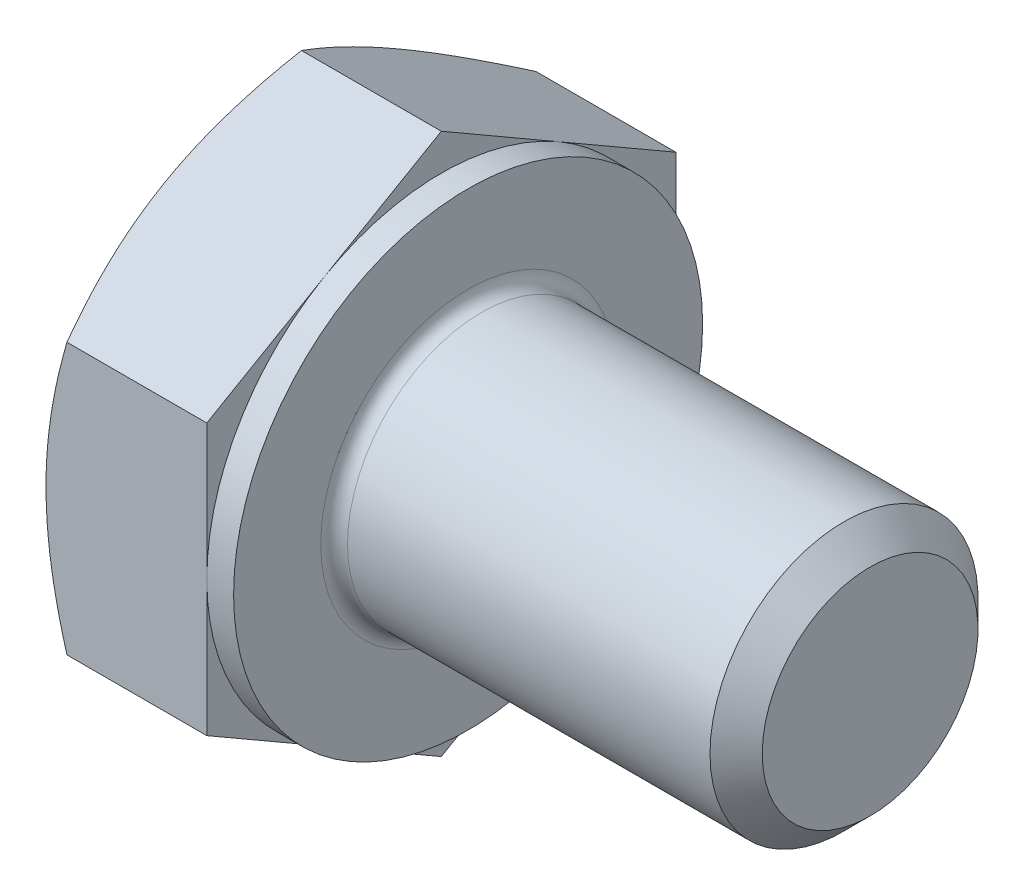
ISO-10303-21;
HEADER;
FILE_DESCRIPTION(('STEP AP214'),'2;1');
FILE_NAME('part.step','',(''),(''),'','','');
FILE_SCHEMA(('AUTOMOTIVE_DESIGN { 1 0 10303 214 1 1 1 1 }'));
ENDSEC;
DATA;
#1=APPLICATION_CONTEXT('core data for automotive mechanical design processes');
#2=APPLICATION_PROTOCOL_DEFINITION('international standard','automotive_design',2000,#1);
#3=PRODUCT_CONTEXT('',#1,'mechanical');
#4=PRODUCT('Part','Part','',(#3));
#5=PRODUCT_RELATED_PRODUCT_CATEGORY('part','',(#4));
#6=PRODUCT_DEFINITION_FORMATION('','',#4);
#7=PRODUCT_DEFINITION_CONTEXT('part definition',#1,'design');
#8=PRODUCT_DEFINITION('design','',#6,#7);
#9=PRODUCT_DEFINITION_SHAPE('','',#8);
#10=(LENGTH_UNIT() NAMED_UNIT(*) SI_UNIT(.MILLI.,.METRE.));
#11=(NAMED_UNIT(*) PLANE_ANGLE_UNIT() SI_UNIT($,.RADIAN.));
#12=(NAMED_UNIT(*) SI_UNIT($,.STERADIAN.) SOLID_ANGLE_UNIT());
#13=UNCERTAINTY_MEASURE_WITH_UNIT(LENGTH_MEASURE(1.E-05),#10,'distance_accuracy_value','');
#14=(GEOMETRIC_REPRESENTATION_CONTEXT(3) GLOBAL_UNCERTAINTY_ASSIGNED_CONTEXT((#13)) GLOBAL_UNIT_ASSIGNED_CONTEXT((#10,
#11,#12)) REPRESENTATION_CONTEXT('',''));
#15=CARTESIAN_POINT('',(0.,0.,0.));
#16=DIRECTION('',(0.,0.,1.));
#17=DIRECTION('',(1.,0.,0.));
#18=AXIS2_PLACEMENT_3D('',#15,#16,#17);
#19=CARTESIAN_POINT('',(2.8,4.04145188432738,0.));
#20=DIRECTION('',(1.,0.,0.));
#21=DIRECTION('',(0.,0.,-1.));
#22=AXIS2_PLACEMENT_3D('',#19,#20,#21);
#23=PLANE('',#22);
#24=CARTESIAN_POINT('',(2.8,0.,0.));
#25=DIRECTION('',(1.,0.,0.));
#26=DIRECTION('',(0.,0.,-1.));
#27=AXIS2_PLACEMENT_3D('',#24,#25,#26);
#28=CIRCLE('',#27,2.2);
#29=CARTESIAN_POINT('',(2.8,0.,-2.2));
#30=VERTEX_POINT('',#29);
#31=EDGE_CURVE('E44',#30,#30,#28,.F.);
#32=ORIENTED_EDGE('',*,*,#31,.T.);
#33=EDGE_LOOP('',(#32));
#34=FACE_BOUND('',#33,.T.);
#35=CARTESIAN_POINT('',(2.8,0.,0.));
#36=DIRECTION('',(1.,0.,0.));
#37=DIRECTION('',(0.,0.,-1.));
#38=AXIS2_PLACEMENT_3D('',#35,#36,#37);
#39=CIRCLE('',#38,3.5);
#40=CARTESIAN_POINT('',(2.8,0.,-3.5));
#41=VERTEX_POINT('',#40);
#42=EDGE_CURVE('E301',#41,#41,#39,.T.);
#43=ORIENTED_EDGE('',*,*,#42,.T.);
#44=EDGE_LOOP('',(#43));
#45=FACE_BOUND('',#44,.T.);
#46=ADVANCED_FACE('F36',(#34,#45),#23,.T.);
#47=CARTESIAN_POINT('',(0.,0.,0.));
#48=DIRECTION('',(-1.,0.,0.));
#49=DIRECTION('',(0.,0.,1.));
#50=AXIS2_PLACEMENT_3D('',#47,#48,#49);
#51=CYLINDRICAL_SURFACE('',#50,2.);
#52=CARTESIAN_POINT('',(3.,0.,0.));
#53=DIRECTION('',(1.,0.,0.));
#54=DIRECTION('',(0.,0.,-1.));
#55=AXIS2_PLACEMENT_3D('',#52,#53,#54);
#56=CIRCLE('',#55,2.);
#57=CARTESIAN_POINT('',(3.,0.,-2.));
#58=VERTEX_POINT('',#57);
#59=EDGE_CURVE('E11',#58,#58,#56,.T.);
#60=ORIENTED_EDGE('',*,*,#59,.T.);
#61=EDGE_LOOP('',(#60));
#62=FACE_BOUND('',#61,.T.);
#63=CARTESIAN_POINT('',(8.41,0.,0.));
#64=DIRECTION('',(-1.,0.,0.));
#65=DIRECTION('',(0.,0.,1.));
#66=AXIS2_PLACEMENT_3D('',#63,#64,#65);
#67=CIRCLE('',#66,2.);
#68=CARTESIAN_POINT('',(8.41,0.,2.));
#69=VERTEX_POINT('',#68);
#70=EDGE_CURVE('E280',#69,#69,#67,.T.);
#71=ORIENTED_EDGE('',*,*,#70,.T.);
#72=EDGE_LOOP('',(#71));
#73=FACE_BOUND('',#72,.T.);
#74=ADVANCED_FACE('F254',(#62,#73),#51,.T.);
#75=CARTESIAN_POINT('',(8.8,0.,0.));
#76=DIRECTION('',(-1.,0.,0.));
#77=DIRECTION('',(0.,0.,1.));
#78=AXIS2_PLACEMENT_3D('',#75,#76,#77);
#79=CONICAL_SURFACE('',#78,1.61,0.785398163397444);
#80=ORIENTED_EDGE('',*,*,#70,.F.);
#81=EDGE_LOOP('',(#80));
#82=FACE_BOUND('',#81,.T.);
#83=CARTESIAN_POINT('',(8.8,0.,0.));
#84=DIRECTION('',(-1.,0.,0.));
#85=DIRECTION('',(0.,0.,1.));
#86=AXIS2_PLACEMENT_3D('',#83,#84,#85);
#87=CIRCLE('',#86,1.61);
#88=CARTESIAN_POINT('',(8.8,0.,1.61));
#89=VERTEX_POINT('',#88);
#90=EDGE_CURVE('E278',#89,#89,#87,.T.);
#91=ORIENTED_EDGE('',*,*,#90,.T.);
#92=EDGE_LOOP('',(#91));
#93=FACE_BOUND('',#92,.T.);
#94=ADVANCED_FACE('F259',(#82,#93),#79,.T.);
#95=CARTESIAN_POINT('',(8.8,0.,0.));
#96=DIRECTION('',(-1.,0.,0.));
#97=DIRECTION('',(0.,0.,1.));
#98=AXIS2_PLACEMENT_3D('',#95,#96,#97);
#99=PLANE('',#98);
#100=ORIENTED_EDGE('',*,*,#90,.F.);
#101=EDGE_LOOP('',(#100));
#102=FACE_BOUND('',#101,.T.);
#103=ADVANCED_FACE('F266',(#102),#99,.F.);
#104=CARTESIAN_POINT('',(2.4,3.5,0.));
#105=DIRECTION('',(1.,0.,0.));
#106=DIRECTION('',(0.,0.,-1.));
#107=AXIS2_PLACEMENT_3D('',#104,#105,#106);
#108=PLANE('',#107);
#109=DIRECTION('',(0.,0.500000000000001,0.866025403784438));
#110=VECTOR('',#109,1.);
#111=CARTESIAN_POINT('',(2.4,2.02072594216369,-3.5));
#112=LINE('',#111,#110);
#113=CARTESIAN_POINT('',(2.4,2.02072594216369,-3.5));
#114=VERTEX_POINT('',#113);
#115=CARTESIAN_POINT('',(2.4,3.03108891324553,-1.75));
#116=VERTEX_POINT('',#115);
#117=EDGE_CURVE('E168',#114,#116,#112,.T.);
#118=ORIENTED_EDGE('',*,*,#117,.T.);
#119=CARTESIAN_POINT('',(2.4,0.,0.));
#120=DIRECTION('',(-1.,0.,0.));
#121=DIRECTION('',(0.,0.,1.));
#122=AXIS2_PLACEMENT_3D('',#119,#120,#121);
#123=CIRCLE('',#122,3.5);
#124=CARTESIAN_POINT('',(2.4,0.,-3.5));
#125=VERTEX_POINT('',#124);
#126=EDGE_CURVE('E51',#116,#125,#123,.T.);
#127=ORIENTED_EDGE('',*,*,#126,.T.);
#128=DIRECTION('',(0.,1.,0.));
#129=VECTOR('',#128,1.);
#130=CARTESIAN_POINT('',(2.4,2.02072594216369,-3.5));
#131=LINE('',#130,#129);
#132=EDGE_CURVE('E304',#125,#114,#131,.T.);
#133=ORIENTED_EDGE('',*,*,#132,.T.);
#134=EDGE_LOOP('',(#118,#127,#133));
#135=FACE_BOUND('',#134,.T.);
#136=ADVANCED_FACE('F269',(#135),#108,.T.);
#137=CARTESIAN_POINT('',(2.4,4.04145188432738,0.));
#138=VERTEX_POINT('',#137);
#139=EDGE_CURVE('E166',#116,#138,#112,.T.);
#140=ORIENTED_EDGE('',*,*,#139,.T.);
#141=DIRECTION('',(0.,-0.500000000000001,0.866025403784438));
#142=VECTOR('',#141,1.);
#143=CARTESIAN_POINT('',(2.4,4.04145188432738,0.));
#144=LINE('',#143,#142);
#145=CARTESIAN_POINT('',(2.4,3.03108891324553,1.75));
#146=VERTEX_POINT('',#145);
#147=EDGE_CURVE('E165',#138,#146,#144,.T.);
#148=ORIENTED_EDGE('',*,*,#147,.T.);
#149=EDGE_CURVE('E154',#146,#116,#123,.T.);
#150=ORIENTED_EDGE('',*,*,#149,.T.);
#151=EDGE_LOOP('',(#140,#148,#150));
#152=FACE_BOUND('',#151,.T.);
#153=ADVANCED_FACE('F274',(#152),#108,.T.);
#154=CARTESIAN_POINT('',(2.4,2.02072594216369,3.5));
#155=VERTEX_POINT('',#154);
#156=EDGE_CURVE('E133',#146,#155,#144,.T.);
#157=ORIENTED_EDGE('',*,*,#156,.T.);
#158=DIRECTION('',(0.,-1.,0.));
#159=VECTOR('',#158,1.);
#160=CARTESIAN_POINT('',(2.4,2.02072594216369,3.5));
#161=LINE('',#160,#159);
#162=CARTESIAN_POINT('',(2.4,0.,3.5));
#163=VERTEX_POINT('',#162);
#164=EDGE_CURVE('E127',#155,#163,#161,.T.);
#165=ORIENTED_EDGE('',*,*,#164,.T.);
#166=EDGE_CURVE('E131',#163,#146,#123,.T.);
#167=ORIENTED_EDGE('',*,*,#166,.T.);
#168=EDGE_LOOP('',(#157,#165,#167));
#169=FACE_BOUND('',#168,.T.);
#170=ADVANCED_FACE('F129',(#169),#108,.T.);
#171=CARTESIAN_POINT('',(2.4,-2.02072594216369,3.5));
#172=VERTEX_POINT('',#171);
#173=EDGE_CURVE('E137',#163,#172,#161,.T.);
#174=ORIENTED_EDGE('',*,*,#173,.T.);
#175=DIRECTION('',(0.,-0.500000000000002,-0.866025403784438));
#176=VECTOR('',#175,1.);
#177=CARTESIAN_POINT('',(2.4,-4.04145188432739,0.));
#178=LINE('',#177,#176);
#179=CARTESIAN_POINT('',(2.4,-3.03108891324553,1.75000000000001));
#180=VERTEX_POINT('',#179);
#181=EDGE_CURVE('E144',#172,#180,#178,.T.);
#182=ORIENTED_EDGE('',*,*,#181,.T.);
#183=EDGE_CURVE('E141',#180,#163,#123,.T.);
#184=ORIENTED_EDGE('',*,*,#183,.T.);
#185=EDGE_LOOP('',(#174,#182,#184));
#186=FACE_BOUND('',#185,.T.);
#187=ADVANCED_FACE('F142',(#186),#108,.T.);
#188=CARTESIAN_POINT('',(2.4,-4.04145188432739,0.));
#189=VERTEX_POINT('',#188);
#190=EDGE_CURVE('E160',#180,#189,#178,.T.);
#191=ORIENTED_EDGE('',*,*,#190,.T.);
#192=DIRECTION('',(0.,0.500000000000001,-0.866025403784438));
#193=VECTOR('',#192,1.);
#194=CARTESIAN_POINT('',(2.4,-2.0207259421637,-3.5));
#195=LINE('',#194,#193);
#196=CARTESIAN_POINT('',(2.4,-3.03108891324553,-1.75));
#197=VERTEX_POINT('',#196);
#198=EDGE_CURVE('E342',#189,#197,#195,.T.);
#199=ORIENTED_EDGE('',*,*,#198,.T.);
#200=EDGE_CURVE('E148',#197,#180,#123,.T.);
#201=ORIENTED_EDGE('',*,*,#200,.T.);
#202=EDGE_LOOP('',(#191,#199,#201));
#203=FACE_BOUND('',#202,.T.);
#204=ADVANCED_FACE('F343',(#203),#108,.T.);
#205=CARTESIAN_POINT('',(2.4,-2.0207259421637,-3.5));
#206=VERTEX_POINT('',#205);
#207=EDGE_CURVE('E155',#197,#206,#195,.T.);
#208=ORIENTED_EDGE('',*,*,#207,.T.);
#209=EDGE_CURVE('E305',#206,#125,#131,.T.);
#210=ORIENTED_EDGE('',*,*,#209,.T.);
#211=EDGE_CURVE('E312',#125,#197,#123,.T.);
#212=ORIENTED_EDGE('',*,*,#211,.T.);
#213=EDGE_LOOP('',(#208,#210,#212));
#214=FACE_BOUND('',#213,.T.);
#215=ADVANCED_FACE('F275',(#214),#108,.T.);
#216=CARTESIAN_POINT('',(0.,0.,0.));
#217=DIRECTION('',(-1.,0.,0.));
#218=DIRECTION('',(0.,0.,1.));
#219=AXIS2_PLACEMENT_3D('',#216,#217,#218);
#220=CYLINDRICAL_SURFACE('',#219,3.5);
#221=ORIENTED_EDGE('',*,*,#126,.F.);
#222=ORIENTED_EDGE('',*,*,#149,.F.);
#223=ORIENTED_EDGE('',*,*,#166,.F.);
#224=ORIENTED_EDGE('',*,*,#183,.F.);
#225=ORIENTED_EDGE('',*,*,#200,.F.);
#226=ORIENTED_EDGE('',*,*,#211,.F.);
#227=EDGE_LOOP('',(#221,#222,#223,#224,#225,#226));
#228=FACE_BOUND('',#227,.T.);
#229=ORIENTED_EDGE('',*,*,#42,.F.);
#230=EDGE_LOOP('',(#229));
#231=FACE_BOUND('',#230,.T.);
#232=ADVANCED_FACE('F151',(#228,#231),#220,.T.);
#233=CARTESIAN_POINT('',(0.,4.04145188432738,0.));
#234=DIRECTION('',(1.,0.,0.));
#235=DIRECTION('',(0.,0.,-1.));
#236=AXIS2_PLACEMENT_3D('',#233,#234,#235);
#237=PLANE('',#236);
#238=CARTESIAN_POINT('',(0.,0.,0.));
#239=DIRECTION('',(1.,0.,0.));
#240=DIRECTION('',(0.,0.,-1.));
#241=AXIS2_PLACEMENT_3D('',#238,#239,#240);
#242=CIRCLE('',#241,3.5);
#243=CARTESIAN_POINT('',(0.,0.,-3.5));
#244=VERTEX_POINT('',#243);
#245=CARTESIAN_POINT('',(0.,3.03108891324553,-1.75));
#246=VERTEX_POINT('',#245);
#247=EDGE_CURVE('E300',#244,#246,#242,.T.);
#248=ORIENTED_EDGE('',*,*,#247,.F.);
#249=CARTESIAN_POINT('',(0.,-3.03108891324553,-1.75));
#250=VERTEX_POINT('',#249);
#251=EDGE_CURVE('E296',#250,#244,#242,.T.);
#252=ORIENTED_EDGE('',*,*,#251,.F.);
#253=CARTESIAN_POINT('',(0.,-3.03108891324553,1.75000000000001));
#254=VERTEX_POINT('',#253);
#255=EDGE_CURVE('E299',#254,#250,#242,.T.);
#256=ORIENTED_EDGE('',*,*,#255,.F.);
#257=CARTESIAN_POINT('',(0.,0.,3.5));
#258=VERTEX_POINT('',#257);
#259=EDGE_CURVE('E335',#258,#254,#242,.T.);
#260=ORIENTED_EDGE('',*,*,#259,.F.);
#261=CARTESIAN_POINT('',(0.,0.,0.));
#262=DIRECTION('',(-1.,0.,0.));
#263=DIRECTION('',(0.,0.,1.));
#264=AXIS2_PLACEMENT_3D('',#261,#262,#263);
#265=CIRCLE('',#264,3.5);
#266=CARTESIAN_POINT('',(0.,3.03108891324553,1.75));
#267=VERTEX_POINT('',#266);
#268=EDGE_CURVE('E169',#258,#267,#265,.T.);
#269=ORIENTED_EDGE('',*,*,#268,.T.);
#270=EDGE_CURVE('E358',#246,#267,#242,.T.);
#271=ORIENTED_EDGE('',*,*,#270,.F.);
#272=EDGE_LOOP('',(#248,#252,#256,#260,#269,#271));
#273=FACE_BOUND('',#272,.T.);
#274=ADVANCED_FACE('F200',(#273),#237,.F.);
#275=CARTESIAN_POINT('',(0.,0.,0.));
#276=DIRECTION('',(1.,0.,0.));
#277=DIRECTION('',(0.,0.,-1.));
#278=AXIS2_PLACEMENT_3D('',#275,#276,#277);
#279=CONICAL_SURFACE('',#278,3.5,1.0471975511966);
#280=CARTESIAN_POINT('',(0.312674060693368,2.02061047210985,3.5002));
#281=CARTESIAN_POINT('',(0.26138578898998,2.10941108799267,3.34639282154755));
#282=CARTESIAN_POINT('',(0.214740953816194,2.19897822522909,3.19125798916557));
#283=CARTESIAN_POINT('',(0.133321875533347,2.37966345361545,2.87830199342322));
#284=CARTESIAN_POINT('',(0.0985764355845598,2.47078475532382,2.7204752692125));
#285=CARTESIAN_POINT('',(0.044490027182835,2.65189807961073,2.40677778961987));
#286=CARTESIAN_POINT('',(0.0247890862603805,2.74186223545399,2.25095530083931));
#287=CARTESIAN_POINT('',(0.00127013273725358,2.92221386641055,1.93857711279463));
#288=CARTESIAN_POINT('',(-0.00256735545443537,3.01260068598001,1.78202254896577));
#289=CARTESIAN_POINT('',(0.00541530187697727,3.1814939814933,1.48949078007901));
#290=CARTESIAN_POINT('',(0.0152754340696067,3.26002573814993,1.35346978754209));
#291=CARTESIAN_POINT('',(0.0465264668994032,3.41657761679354,1.08231397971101));
#292=CARTESIAN_POINT('',(0.0679280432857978,3.49459719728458,0.947180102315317));
#293=CARTESIAN_POINT('',(0.121430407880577,3.65147186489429,0.675465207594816));
#294=CARTESIAN_POINT('',(0.153757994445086,3.73030709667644,0.538918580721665));
#295=CARTESIAN_POINT('',(0.227128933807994,3.88680174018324,0.267861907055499));
#296=CARTESIAN_POINT('',(0.268155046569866,3.96446315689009,0.133348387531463));
#297=CARTESIAN_POINT('',(0.31267406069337,4.04156735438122,-0.000200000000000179));
#298=B_SPLINE_CURVE_WITH_KNOTS('',3,(#280,#281,#282,#283,#284,#285,#286,#287,#288,#289,#290,
#291,#292,#293,#294,#295,#296,#297),.UNSPECIFIED.,.F.,.F.,(4,2,2,2,2,2,2,2,4),(0.,
0.554793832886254,1.11092123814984,1.65328467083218,2.19498204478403,2.6666513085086,
3.13875761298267,3.62133612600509,4.10296698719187),.UNSPECIFIED.);
#299=CARTESIAN_POINT('',(0.312607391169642,4.04145188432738,0.));
#300=VERTEX_POINT('',#299);
#301=EDGE_CURVE('E220',#267,#300,#298,.T.);
#302=ORIENTED_EDGE('',*,*,#301,.T.);
#303=CARTESIAN_POINT('',(0.31267406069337,4.04156735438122,0.0002));
#304=CARTESIAN_POINT('',(0.261385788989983,3.9527667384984,-0.15360717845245));
#305=CARTESIAN_POINT('',(0.214740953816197,3.86319960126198,-0.308742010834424));
#306=CARTESIAN_POINT('',(0.133321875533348,3.68251437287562,-0.621698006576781));
#307=CARTESIAN_POINT('',(0.098576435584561,3.59139307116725,-0.779524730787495));
#308=CARTESIAN_POINT('',(0.0444900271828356,3.41027974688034,-1.09322221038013));
#309=CARTESIAN_POINT('',(0.024789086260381,3.32031559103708,-1.24904469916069));
#310=CARTESIAN_POINT('',(0.00127013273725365,3.13996396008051,-1.56142288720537));
#311=CARTESIAN_POINT('',(-0.00256735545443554,3.04957714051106,-1.71797745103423));
#312=CARTESIAN_POINT('',(0.00541530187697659,2.88068384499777,-2.01050921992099));
#313=CARTESIAN_POINT('',(0.0152754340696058,2.80215208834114,-2.1465302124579));
#314=CARTESIAN_POINT('',(0.0465264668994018,2.64560020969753,-2.41768602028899));
#315=CARTESIAN_POINT('',(0.0679280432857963,2.56758062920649,-2.55281989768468));
#316=CARTESIAN_POINT('',(0.121430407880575,2.41070596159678,-2.82453479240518));
#317=CARTESIAN_POINT('',(0.153757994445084,2.33187072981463,-2.96108141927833));
#318=CARTESIAN_POINT('',(0.227128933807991,2.17537608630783,-3.2321380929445));
#319=CARTESIAN_POINT('',(0.268155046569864,2.09771466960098,-3.36665161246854));
#320=CARTESIAN_POINT('',(0.312674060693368,2.02061047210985,-3.5002));
#321=B_SPLINE_CURVE_WITH_KNOTS('',3,(#303,#304,#305,#306,#307,#308,#309,#310,#311,#312,#313,
#314,#315,#316,#317,#318,#319,#320),.UNSPECIFIED.,.F.,.F.,(4,2,2,2,2,2,2,2,4),(0.,
0.554793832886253,1.11092123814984,1.65328467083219,2.19498204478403,2.6666513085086,
3.13875761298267,3.6213361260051,4.10296698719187),.UNSPECIFIED.);
#322=EDGE_CURVE('E59',#300,#246,#321,.T.);
#323=ORIENTED_EDGE('',*,*,#322,.T.);
#324=ORIENTED_EDGE('',*,*,#270,.T.);
#325=EDGE_LOOP('',(#302,#323,#324));
#326=FACE_BOUND('',#325,.T.);
#327=ADVANCED_FACE('F359',(#326),#279,.T.);
#328=CARTESIAN_POINT('',(1.74876972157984,-5.51155991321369,3.5));
#329=CARTESIAN_POINT('',(1.67392335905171,-5.3579514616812,3.5));
#330=CARTESIAN_POINT('',(1.59977092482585,-5.20399921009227,3.5));
#331=CARTESIAN_POINT('',(1.45324265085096,-4.8952245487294,3.5));
#332=CARTESIAN_POINT('',(1.38086707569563,-4.74040201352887,3.5));
#333=CARTESIAN_POINT('',(1.23793493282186,-4.42894615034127,3.5));
#334=CARTESIAN_POINT('',(1.16738971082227,-4.27230759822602,3.5));
#335=CARTESIAN_POINT('',(1.02907715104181,-3.95781335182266,3.5));
#336=CARTESIAN_POINT('',(0.961309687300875,-3.79995771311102,3.5));
#337=CARTESIAN_POINT('',(0.827049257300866,-3.47741113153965,3.5));
#338=CARTESIAN_POINT('',(0.760677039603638,-3.31266966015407,3.5));
#339=CARTESIAN_POINT('',(0.632756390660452,-2.98129055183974,3.5));
#340=CARTESIAN_POINT('',(0.571208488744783,-2.81465270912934,3.5));
#341=CARTESIAN_POINT('',(0.454490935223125,-2.47950135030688,3.5));
#342=CARTESIAN_POINT('',(0.39930907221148,-2.31099212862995,3.5));
#343=CARTESIAN_POINT('',(0.297038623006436,-1.97155788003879,3.5));
#344=CARTESIAN_POINT('',(0.249947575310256,-1.80063360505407,3.5));
#345=CARTESIAN_POINT('',(0.166312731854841,-1.45721769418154,3.5));
#346=CARTESIAN_POINT('',(0.129709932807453,-1.28474069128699,3.5));
#347=CARTESIAN_POINT('',(0.0690664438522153,-0.937557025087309,3.5));
#348=CARTESIAN_POINT('',(0.0450243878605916,-0.762850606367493,3.5));
#349=CARTESIAN_POINT('',(0.0117307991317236,-0.414396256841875,3.5));
#350=CARTESIAN_POINT('',(0.00228260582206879,-0.240667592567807,3.5));
#351=CARTESIAN_POINT('',(-0.0015455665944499,0.106974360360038,3.5));
#352=CARTESIAN_POINT('',(0.00407467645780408,0.280887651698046,3.5));
#353=CARTESIAN_POINT('',(0.0258160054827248,0.573677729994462,3.5));
#354=CARTESIAN_POINT('',(0.0381294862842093,0.692856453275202,3.5));
#355=CARTESIAN_POINT('',(0.0691104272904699,0.930390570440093,3.5));
#356=CARTESIAN_POINT('',(0.0877786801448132,1.04874585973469,3.5));
#357=CARTESIAN_POINT('',(0.152339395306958,1.40238821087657,3.5));
#358=CARTESIAN_POINT('',(0.206777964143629,1.63613518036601,3.5));
#359=CARTESIAN_POINT('',(0.301818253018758,1.98584040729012,3.5));
#360=CARTESIAN_POINT('',(0.336200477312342,2.10359260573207,3.5));
#361=CARTESIAN_POINT('',(0.408694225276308,2.33795452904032,3.5));
#362=CARTESIAN_POINT('',(0.446805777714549,2.45456424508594,3.5));
#363=CARTESIAN_POINT('',(0.526133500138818,2.68667648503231,3.5));
#364=CARTESIAN_POINT('',(0.567348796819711,2.80217931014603,3.5));
#365=CARTESIAN_POINT('',(0.652383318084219,3.03221622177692,3.5));
#366=CARTESIAN_POINT('',(0.696202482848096,3.14675033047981,3.5));
#367=CARTESIAN_POINT('',(0.817586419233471,3.45518824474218,3.5));
#368=CARTESIAN_POINT('',(0.897216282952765,3.64827858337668,3.5));
#369=CARTESIAN_POINT('',(1.061161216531,4.03246733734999,3.5));
#370=CARTESIAN_POINT('',(1.1454768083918,4.22356552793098,3.5));
#371=CARTESIAN_POINT('',(1.31768022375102,4.60422080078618,3.5));
#372=CARTESIAN_POINT('',(1.4055692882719,4.7937773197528,3.5));
#373=CARTESIAN_POINT('',(1.5840729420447,5.17160542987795,3.5));
#374=CARTESIAN_POINT('',(1.67468761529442,5.35987698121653,3.5));
#375=CARTESIAN_POINT('',(1.85818750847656,5.73567568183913,3.5));
#376=CARTESIAN_POINT('',(1.95107608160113,5.92320119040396,3.5));
#377=CARTESIAN_POINT('',(2.13854805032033,6.29740401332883,3.5));
#378=CARTESIAN_POINT('',(2.23313146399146,6.48408131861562,3.49999999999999));
#379=CARTESIAN_POINT('',(2.51886264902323,7.04299370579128,3.49999999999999));
#380=CARTESIAN_POINT('',(2.71203324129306,7.41419418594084,3.49999999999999));
#381=CARTESIAN_POINT('',(3.08131090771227,8.11545297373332,3.49999999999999));
#382=CARTESIAN_POINT('',(3.25705679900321,8.44570240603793,3.49999999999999));
#383=CARTESIAN_POINT('',(3.61066708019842,9.10509095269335,3.49999999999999));
#384=CARTESIAN_POINT('',(3.7885316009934,9.43422999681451,3.49999999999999));
#385=CARTESIAN_POINT('',(4.14522643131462,10.0905480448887,3.49999999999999));
#386=CARTESIAN_POINT('',(4.32405147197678,10.4177299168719,3.49999999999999));
#387=CARTESIAN_POINT('',(4.68290305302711,11.0714005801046,3.49999999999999));
#388=CARTESIAN_POINT('',(4.86292949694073,11.397889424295,3.49999999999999));
#389=CARTESIAN_POINT('',(5.0433932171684,11.7241348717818,3.49999999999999));
#390=B_SPLINE_CURVE_WITH_KNOTS('',3,(#328,#329,#330,#331,#332,#333,#334,#335,#336,#337,#338,
#339,#340,#341,#342,#343,#344,#345,#346,#347,#348,#349,#350,#351,#352,#353,#354,#355,#356,#357,
#358,#359,#360,#361,#362,#363,#364,#365,#366,#367,#368,#369,#370,#371,#372,#373,#374,#375,#376,
#377,#378,#379,#380,#381,#382,#383,#384,#385,#386,#387,#388,#389),.UNSPECIFIED.,.F.,.F.,(4,2,2,
2,2,2,2,2,2,2,2,2,2,2,2,2,2,2,2,2,2,2,2,2,2,2,2,2,2,2,4),(0.,0.512624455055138,1.02532478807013,
1.54067716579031,2.05600614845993,2.58877526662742,3.12160275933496,3.6533905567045,
4.18501627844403,4.71358974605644,5.24210571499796,5.76343550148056,6.28477297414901,
6.64403977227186,7.00335139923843,7.72232402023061,8.0902978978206,8.45827461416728,
8.82614817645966,9.1940132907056,9.82051720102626,10.4470910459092,11.0738843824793,
11.7006970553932,12.3284975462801,12.9563047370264,14.2116350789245,15.333929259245,
16.4562931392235,17.5748776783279,18.6933734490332),.UNSPECIFIED.);
#391=CARTESIAN_POINT('',(0.31260739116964,2.02072594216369,3.5));
#392=VERTEX_POINT('',#391);
#393=EDGE_CURVE('E234',#258,#392,#390,.T.);
#394=ORIENTED_EDGE('',*,*,#393,.T.);
#395=EDGE_CURVE('E233',#392,#267,#298,.T.);
#396=ORIENTED_EDGE('',*,*,#395,.T.);
#397=ORIENTED_EDGE('',*,*,#268,.F.);
#398=EDGE_LOOP('',(#394,#396,#397));
#399=FACE_BOUND('',#398,.T.);
#400=ADVANCED_FACE('F329',(#399),#279,.T.);
#401=CARTESIAN_POINT('',(0.312607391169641,-2.02072594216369,3.5));
#402=VERTEX_POINT('',#401);
#403=EDGE_CURVE('E281',#402,#258,#390,.T.);
#404=ORIENTED_EDGE('',*,*,#403,.T.);
#405=ORIENTED_EDGE('',*,*,#259,.T.);
#406=CARTESIAN_POINT('',(0.312674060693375,-4.04156735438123,-0.000200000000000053));
#407=CARTESIAN_POINT('',(0.261385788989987,-3.95276673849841,0.15360717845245));
#408=CARTESIAN_POINT('',(0.214740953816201,-3.86319960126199,0.308742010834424));
#409=CARTESIAN_POINT('',(0.133321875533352,-3.68251437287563,0.621698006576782));
#410=CARTESIAN_POINT('',(0.0985764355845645,-3.59139307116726,0.779524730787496));
#411=CARTESIAN_POINT('',(0.0444900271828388,-3.41027974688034,1.09322221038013));
#412=CARTESIAN_POINT('',(0.0247890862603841,-3.32031559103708,1.24904469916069));
#413=CARTESIAN_POINT('',(0.00127013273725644,-3.13996396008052,1.56142288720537));
#414=CARTESIAN_POINT('',(-0.00256735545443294,-3.04957714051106,1.71797745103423));
#415=CARTESIAN_POINT('',(0.00541530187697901,-2.88068384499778,2.01050921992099));
#416=CARTESIAN_POINT('',(0.0152754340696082,-2.80215208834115,2.14653021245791));
#417=CARTESIAN_POINT('',(0.0465264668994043,-2.64560020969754,2.417686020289));
#418=CARTESIAN_POINT('',(0.0679280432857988,-2.5675806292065,2.55281989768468));
#419=CARTESIAN_POINT('',(0.121430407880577,-2.41070596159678,2.82453479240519));
#420=CARTESIAN_POINT('',(0.153757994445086,-2.33187072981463,2.96108141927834));
#421=CARTESIAN_POINT('',(0.227128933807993,-2.17537608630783,3.2321380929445));
#422=CARTESIAN_POINT('',(0.268155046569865,-2.09771466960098,3.36665161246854));
#423=CARTESIAN_POINT('',(0.312674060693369,-2.02061047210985,3.5002));
#424=B_SPLINE_CURVE_WITH_KNOTS('',3,(#406,#407,#408,#409,#410,#411,#412,#413,#414,#415,#416,
#417,#418,#419,#420,#421,#422,#423),.UNSPECIFIED.,.F.,.F.,(4,2,2,2,2,2,2,2,4),(0.,
0.554793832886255,1.11092123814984,1.65328467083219,2.19498204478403,2.6666513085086,
3.13875761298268,3.6213361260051,4.10296698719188),.UNSPECIFIED.);
#425=EDGE_CURVE('E222',#254,#402,#424,.T.);
#426=ORIENTED_EDGE('',*,*,#425,.T.);
#427=EDGE_LOOP('',(#404,#405,#426));
#428=FACE_BOUND('',#427,.T.);
#429=ADVANCED_FACE('F189',(#428),#279,.T.);
#430=CARTESIAN_POINT('',(0.312607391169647,-4.04145188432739,0.));
#431=VERTEX_POINT('',#430);
#432=EDGE_CURVE('E214',#431,#254,#424,.T.);
#433=ORIENTED_EDGE('',*,*,#432,.T.);
#434=ORIENTED_EDGE('',*,*,#255,.T.);
#435=CARTESIAN_POINT('',(0.312674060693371,-2.02061047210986,-3.5002));
#436=CARTESIAN_POINT('',(0.261385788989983,-2.10941108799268,-3.34639282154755));
#437=CARTESIAN_POINT('',(0.214740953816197,-2.1989782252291,-3.19125798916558));
#438=CARTESIAN_POINT('',(0.13332187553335,-2.37966345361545,-2.87830199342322));
#439=CARTESIAN_POINT('',(0.0985764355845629,-2.47078475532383,-2.7204752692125));
#440=CARTESIAN_POINT('',(0.0444900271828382,-2.65189807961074,-2.40677778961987));
#441=CARTESIAN_POINT('',(0.0247890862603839,-2.741862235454,-2.25095530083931));
#442=CARTESIAN_POINT('',(0.00127013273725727,-2.92221386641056,-1.93857711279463));
#443=CARTESIAN_POINT('',(-0.00256735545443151,-3.01260068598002,-1.78202254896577));
#444=CARTESIAN_POINT('',(0.00541530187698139,-3.18149398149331,-1.48949078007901));
#445=CARTESIAN_POINT('',(0.0152754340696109,-3.26002573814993,-1.35346978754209));
#446=CARTESIAN_POINT('',(0.0465264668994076,-3.41657761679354,-1.08231397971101));
#447=CARTESIAN_POINT('',(0.0679280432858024,-3.49459719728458,-0.947180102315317));
#448=CARTESIAN_POINT('',(0.121430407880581,-3.6514718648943,-0.675465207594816));
#449=CARTESIAN_POINT('',(0.153757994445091,-3.73030709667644,-0.538918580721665));
#450=CARTESIAN_POINT('',(0.227128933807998,-3.88680174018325,-0.267861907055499));
#451=CARTESIAN_POINT('',(0.268155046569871,-3.9644631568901,-0.133348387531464));
#452=CARTESIAN_POINT('',(0.312674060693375,-4.04156735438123,0.000199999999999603));
#453=B_SPLINE_CURVE_WITH_KNOTS('',3,(#435,#436,#437,#438,#439,#440,#441,#442,#443,#444,#445,
#446,#447,#448,#449,#450,#451,#452),.UNSPECIFIED.,.F.,.F.,(4,2,2,2,2,2,2,2,4),(0.,
0.554793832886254,1.11092123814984,1.65328467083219,2.19498204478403,2.6666513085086,
3.13875761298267,3.6213361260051,4.10296698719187),.UNSPECIFIED.);
#454=EDGE_CURVE('E221',#250,#431,#453,.T.);
#455=ORIENTED_EDGE('',*,*,#454,.T.);
#456=EDGE_LOOP('',(#433,#434,#455));
#457=FACE_BOUND('',#456,.T.);
#458=ADVANCED_FACE('F357',(#457),#279,.T.);
#459=CARTESIAN_POINT('',(0.31260739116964,2.02072594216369,-3.5));
#460=VERTEX_POINT('',#459);
#461=EDGE_CURVE('E223',#246,#460,#321,.T.);
#462=ORIENTED_EDGE('',*,*,#461,.T.);
#463=CARTESIAN_POINT('',(1.74876972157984,-5.51155991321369,-3.5));
#464=CARTESIAN_POINT('',(1.67392335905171,-5.35795146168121,-3.5));
#465=CARTESIAN_POINT('',(1.59977092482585,-5.20399921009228,-3.5));
#466=CARTESIAN_POINT('',(1.45324265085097,-4.89522454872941,-3.5));
#467=CARTESIAN_POINT('',(1.38086707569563,-4.74040201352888,-3.5));
#468=CARTESIAN_POINT('',(1.23793493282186,-4.42894615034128,-3.5));
#469=CARTESIAN_POINT('',(1.16738971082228,-4.27230759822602,-3.5));
#470=CARTESIAN_POINT('',(1.02907715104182,-3.95781335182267,-3.5));
#471=CARTESIAN_POINT('',(0.961309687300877,-3.79995771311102,-3.5));
#472=CARTESIAN_POINT('',(0.827049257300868,-3.47741113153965,-3.5));
#473=CARTESIAN_POINT('',(0.760677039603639,-3.31266966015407,-3.5));
#474=CARTESIAN_POINT('',(0.632756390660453,-2.98129055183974,-3.5));
#475=CARTESIAN_POINT('',(0.571208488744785,-2.81465270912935,-3.5));
#476=CARTESIAN_POINT('',(0.454490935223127,-2.47950135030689,-3.5));
#477=CARTESIAN_POINT('',(0.399309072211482,-2.31099212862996,-3.5));
#478=CARTESIAN_POINT('',(0.297038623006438,-1.9715578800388,-3.5));
#479=CARTESIAN_POINT('',(0.249947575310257,-1.80063360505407,-3.5));
#480=CARTESIAN_POINT('',(0.166312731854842,-1.45721769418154,-3.5));
#481=CARTESIAN_POINT('',(0.129709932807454,-1.284740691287,-3.5));
#482=CARTESIAN_POINT('',(0.0690664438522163,-0.937557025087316,-3.5));
#483=CARTESIAN_POINT('',(0.0450243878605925,-0.762850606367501,-3.5));
#484=CARTESIAN_POINT('',(0.0117307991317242,-0.414396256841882,-3.5));
#485=CARTESIAN_POINT('',(0.00228260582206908,-0.240667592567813,-3.5));
#486=CARTESIAN_POINT('',(-0.00154556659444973,0.106974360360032,-3.5));
#487=CARTESIAN_POINT('',(0.00407467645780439,0.28088765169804,-3.5));
#488=CARTESIAN_POINT('',(0.0258160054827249,0.573677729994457,-3.5));
#489=CARTESIAN_POINT('',(0.0381294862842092,0.692856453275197,-3.5));
#490=CARTESIAN_POINT('',(0.0691104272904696,0.930390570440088,-3.5));
#491=CARTESIAN_POINT('',(0.0877786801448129,1.04874585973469,-3.5));
#492=CARTESIAN_POINT('',(0.152339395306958,1.40238821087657,-3.5));
#493=CARTESIAN_POINT('',(0.206777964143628,1.63613518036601,-3.5));
#494=CARTESIAN_POINT('',(0.301818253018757,1.98584040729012,-3.5));
#495=CARTESIAN_POINT('',(0.336200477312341,2.10359260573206,-3.5));
#496=CARTESIAN_POINT('',(0.408694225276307,2.33795452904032,-3.5));
#497=CARTESIAN_POINT('',(0.446805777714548,2.45456424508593,-3.5));
#498=CARTESIAN_POINT('',(0.526133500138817,2.6866764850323,-3.5));
#499=CARTESIAN_POINT('',(0.56734879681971,2.80217931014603,-3.5));
#500=CARTESIAN_POINT('',(0.652383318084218,3.03221622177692,-3.5));
#501=CARTESIAN_POINT('',(0.696202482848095,3.1467503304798,-3.5));
#502=CARTESIAN_POINT('',(0.81758641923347,3.45518824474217,-3.5));
#503=CARTESIAN_POINT('',(0.897216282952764,3.64827858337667,-3.5));
#504=CARTESIAN_POINT('',(1.061161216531,4.03246733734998,-3.5));
#505=CARTESIAN_POINT('',(1.1454768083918,4.22356552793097,-3.5));
#506=CARTESIAN_POINT('',(1.31768022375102,4.60422080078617,-3.5));
#507=CARTESIAN_POINT('',(1.4055692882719,4.7937773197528,-3.5));
#508=CARTESIAN_POINT('',(1.5840729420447,5.17160542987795,-3.5));
#509=CARTESIAN_POINT('',(1.67468761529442,5.35987698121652,-3.5));
#510=CARTESIAN_POINT('',(1.85818750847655,5.73567568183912,-3.5));
#511=CARTESIAN_POINT('',(1.95107608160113,5.92320119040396,-3.5));
#512=CARTESIAN_POINT('',(2.13854805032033,6.29740401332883,-3.5));
#513=CARTESIAN_POINT('',(2.23313146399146,6.48408131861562,-3.5));
#514=CARTESIAN_POINT('',(2.51886264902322,7.04299370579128,-3.5));
#515=CARTESIAN_POINT('',(2.71203324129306,7.41419418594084,-3.5));
#516=CARTESIAN_POINT('',(3.08131090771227,8.11545297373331,-3.5));
#517=CARTESIAN_POINT('',(3.25705679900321,8.44570240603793,-3.5));
#518=CARTESIAN_POINT('',(3.61066708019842,9.10509095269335,-3.5));
#519=CARTESIAN_POINT('',(3.7885316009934,9.43422999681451,-3.5));
#520=CARTESIAN_POINT('',(4.14522643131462,10.0905480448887,-3.5));
#521=CARTESIAN_POINT('',(4.32405147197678,10.4177299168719,-3.5));
#522=CARTESIAN_POINT('',(4.68290305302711,11.0714005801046,-3.5));
#523=CARTESIAN_POINT('',(4.86292949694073,11.397889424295,-3.5));
#524=CARTESIAN_POINT('',(5.0433932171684,11.7241348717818,-3.5));
#525=B_SPLINE_CURVE_WITH_KNOTS('',3,(#463,#464,#465,#466,#467,#468,#469,#470,#471,#472,#473,
#474,#475,#476,#477,#478,#479,#480,#481,#482,#483,#484,#485,#486,#487,#488,#489,#490,#491,#492,
#493,#494,#495,#496,#497,#498,#499,#500,#501,#502,#503,#504,#505,#506,#507,#508,#509,#510,#511,
#512,#513,#514,#515,#516,#517,#518,#519,#520,#521,#522,#523,#524),.UNSPECIFIED.,.F.,.F.,(4,2,2,
2,2,2,2,2,2,2,2,2,2,2,2,2,2,2,2,2,2,2,2,2,2,2,2,2,2,2,4),(0.,0.512624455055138,1.02532478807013,
1.54067716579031,2.05600614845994,2.58877526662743,3.12160275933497,3.6533905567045,
4.18501627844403,4.71358974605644,5.24210571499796,5.76343550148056,6.28477297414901,
6.64403977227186,7.00335139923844,7.72232402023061,8.09029789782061,8.45827461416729,
8.82614817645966,9.1940132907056,9.82051720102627,10.4470910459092,11.0738843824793,
11.7006970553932,12.3284975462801,12.9563047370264,14.2116350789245,15.333929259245,
16.4562931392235,17.5748776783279,18.6933734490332),.UNSPECIFIED.);
#526=EDGE_CURVE('E181',#460,#244,#525,.F.);
#527=ORIENTED_EDGE('',*,*,#526,.T.);
#528=ORIENTED_EDGE('',*,*,#247,.T.);
#529=EDGE_LOOP('',(#462,#527,#528));
#530=FACE_BOUND('',#529,.T.);
#531=ADVANCED_FACE('F354',(#530),#279,.T.);
#532=CARTESIAN_POINT('',(0.312607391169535,-2.02072594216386,-3.5));
#533=VERTEX_POINT('',#532);
#534=EDGE_CURVE('E182',#533,#250,#453,.T.);
#535=ORIENTED_EDGE('',*,*,#534,.T.);
#536=ORIENTED_EDGE('',*,*,#251,.T.);
#537=EDGE_CURVE('E172',#244,#533,#525,.F.);
#538=ORIENTED_EDGE('',*,*,#537,.T.);
#539=EDGE_LOOP('',(#535,#536,#538));
#540=FACE_BOUND('',#539,.T.);
#541=ADVANCED_FACE('F198',(#540),#279,.T.);
#542=CARTESIAN_POINT('',(2.8,2.02072594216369,-3.5));
#543=DIRECTION('',(0.,0.,1.));
#544=DIRECTION('',(1.,0.,0.));
#545=AXIS2_PLACEMENT_3D('',#542,#543,#544);
#546=PLANE('',#545);
#547=ORIENTED_EDGE('',*,*,#209,.F.);
#548=DIRECTION('',(-1.,0.,0.));
#549=VECTOR('',#548,1.);
#550=CARTESIAN_POINT('',(2.8,-2.0207259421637,-3.5));
#551=LINE('',#550,#549);
#552=EDGE_CURVE('E287',#206,#533,#551,.T.);
#553=ORIENTED_EDGE('',*,*,#552,.T.);
#554=ORIENTED_EDGE('',*,*,#537,.F.);
#555=ORIENTED_EDGE('',*,*,#526,.F.);
#556=DIRECTION('',(-1.,0.,0.));
#557=VECTOR('',#556,1.);
#558=CARTESIAN_POINT('',(2.8,2.02072594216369,-3.5));
#559=LINE('',#558,#557);
#560=EDGE_CURVE('E283',#114,#460,#559,.T.);
#561=ORIENTED_EDGE('',*,*,#560,.F.);
#562=ORIENTED_EDGE('',*,*,#132,.F.);
#563=EDGE_LOOP('',(#547,#553,#554,#555,#561,#562));
#564=FACE_BOUND('',#563,.T.);
#565=ADVANCED_FACE('F193',(#564),#546,.F.);
#566=CARTESIAN_POINT('',(2.8,-2.0207259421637,-3.5));
#567=DIRECTION('',(0.,0.866025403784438,0.500000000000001));
#568=DIRECTION('',(0.,-0.500000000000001,0.866025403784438));
#569=AXIS2_PLACEMENT_3D('',#566,#567,#568);
#570=PLANE('',#569);
#571=ORIENTED_EDGE('',*,*,#198,.F.);
#572=DIRECTION('',(-1.,0.,0.));
#573=VECTOR('',#572,1.);
#574=CARTESIAN_POINT('',(2.8,-4.04145188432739,0.));
#575=LINE('',#574,#573);
#576=EDGE_CURVE('E289',#189,#431,#575,.T.);
#577=ORIENTED_EDGE('',*,*,#576,.T.);
#578=ORIENTED_EDGE('',*,*,#454,.F.);
#579=ORIENTED_EDGE('',*,*,#534,.F.);
#580=ORIENTED_EDGE('',*,*,#552,.F.);
#581=ORIENTED_EDGE('',*,*,#207,.F.);
#582=EDGE_LOOP('',(#571,#577,#578,#579,#580,#581));
#583=FACE_BOUND('',#582,.T.);
#584=ADVANCED_FACE('F197',(#583),#570,.F.);
#585=CARTESIAN_POINT('',(2.8,-4.04145188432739,0.));
#586=DIRECTION('',(0.,0.866025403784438,-0.500000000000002));
#587=DIRECTION('',(0.,0.500000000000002,0.866025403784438));
#588=AXIS2_PLACEMENT_3D('',#585,#586,#587);
#589=PLANE('',#588);
#590=ORIENTED_EDGE('',*,*,#181,.F.);
#591=DIRECTION('',(-1.,0.,0.));
#592=VECTOR('',#591,1.);
#593=CARTESIAN_POINT('',(2.8,-2.02072594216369,3.5));
#594=LINE('',#593,#592);
#595=EDGE_CURVE('E159',#172,#402,#594,.T.);
#596=ORIENTED_EDGE('',*,*,#595,.T.);
#597=ORIENTED_EDGE('',*,*,#425,.F.);
#598=ORIENTED_EDGE('',*,*,#432,.F.);
#599=ORIENTED_EDGE('',*,*,#576,.F.);
#600=ORIENTED_EDGE('',*,*,#190,.F.);
#601=EDGE_LOOP('',(#590,#596,#597,#598,#599,#600));
#602=FACE_BOUND('',#601,.T.);
#603=ADVANCED_FACE('F205',(#602),#589,.F.);
#604=CARTESIAN_POINT('',(2.8,2.02072594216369,3.5));
#605=DIRECTION('',(0.,0.,-1.));
#606=DIRECTION('',(0.,1.,0.));
#607=AXIS2_PLACEMENT_3D('',#604,#605,#606);
#608=PLANE('',#607);
#609=ORIENTED_EDGE('',*,*,#164,.F.);
#610=DIRECTION('',(-1.,0.,0.));
#611=VECTOR('',#610,1.);
#612=CARTESIAN_POINT('',(2.8,2.02072594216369,3.5));
#613=LINE('',#612,#611);
#614=EDGE_CURVE('E292',#155,#392,#613,.T.);
#615=ORIENTED_EDGE('',*,*,#614,.T.);
#616=ORIENTED_EDGE('',*,*,#393,.F.);
#617=ORIENTED_EDGE('',*,*,#403,.F.);
#618=ORIENTED_EDGE('',*,*,#595,.F.);
#619=ORIENTED_EDGE('',*,*,#173,.F.);
#620=EDGE_LOOP('',(#609,#615,#616,#617,#618,#619));
#621=FACE_BOUND('',#620,.T.);
#622=ADVANCED_FACE('F157',(#621),#608,.F.);
#623=CARTESIAN_POINT('',(2.8,4.04145188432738,0.));
#624=DIRECTION('',(0.,-0.866025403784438,-0.500000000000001));
#625=DIRECTION('',(0.,0.500000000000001,-0.866025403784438));
#626=AXIS2_PLACEMENT_3D('',#623,#624,#625);
#627=PLANE('',#626);
#628=ORIENTED_EDGE('',*,*,#147,.F.);
#629=DIRECTION('',(-1.,0.,0.));
#630=VECTOR('',#629,1.);
#631=CARTESIAN_POINT('',(2.8,4.04145188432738,0.));
#632=LINE('',#631,#630);
#633=EDGE_CURVE('E294',#138,#300,#632,.T.);
#634=ORIENTED_EDGE('',*,*,#633,.T.);
#635=ORIENTED_EDGE('',*,*,#301,.F.);
#636=ORIENTED_EDGE('',*,*,#395,.F.);
#637=ORIENTED_EDGE('',*,*,#614,.F.);
#638=ORIENTED_EDGE('',*,*,#156,.F.);
#639=EDGE_LOOP('',(#628,#634,#635,#636,#637,#638));
#640=FACE_BOUND('',#639,.T.);
#641=ADVANCED_FACE('F240',(#640),#627,.F.);
#642=CARTESIAN_POINT('',(2.8,2.02072594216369,-3.5));
#643=DIRECTION('',(0.,-0.866025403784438,0.500000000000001));
#644=DIRECTION('',(0.,-0.500000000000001,-0.866025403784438));
#645=AXIS2_PLACEMENT_3D('',#642,#643,#644);
#646=PLANE('',#645);
#647=ORIENTED_EDGE('',*,*,#117,.F.);
#648=ORIENTED_EDGE('',*,*,#560,.T.);
#649=ORIENTED_EDGE('',*,*,#461,.F.);
#650=ORIENTED_EDGE('',*,*,#322,.F.);
#651=ORIENTED_EDGE('',*,*,#633,.F.);
#652=ORIENTED_EDGE('',*,*,#139,.F.);
#653=EDGE_LOOP('',(#647,#648,#649,#650,#651,#652));
#654=FACE_BOUND('',#653,.T.);
#655=ADVANCED_FACE('F243',(#654),#646,.F.);
#656=CARTESIAN_POINT('',(3.,0.,0.));
#657=DIRECTION('',(1.,0.,0.));
#658=DIRECTION('',(0.,0.,-1.));
#659=AXIS2_PLACEMENT_3D('',#656,#657,#658);
#660=TOROIDAL_SURFACE('',#659,2.2,0.2);
#661=ORIENTED_EDGE('',*,*,#59,.F.);
#662=EDGE_LOOP('',(#661));
#663=FACE_BOUND('',#662,.T.);
#664=ORIENTED_EDGE('',*,*,#31,.F.);
#665=EDGE_LOOP('',(#664));
#666=FACE_BOUND('',#665,.T.);
#667=ADVANCED_FACE('F38',(#663,#666),#660,.F.);
#668=CLOSED_SHELL('',(#46,#74,#94,#103,#136,#153,#170,#187,#204,#215,#232,#274,#327,#400,#429,
#458,#531,#541,#565,#584,#603,#622,#641,#655,#667));
#669=MANIFOLD_SOLID_BREP('B2',#668);
#670=ADVANCED_BREP_SHAPE_REPRESENTATION('',(#18,#669),#14);
#671=SHAPE_DEFINITION_REPRESENTATION(#9,#670);
ENDSEC;
END-ISO-10303-21;
